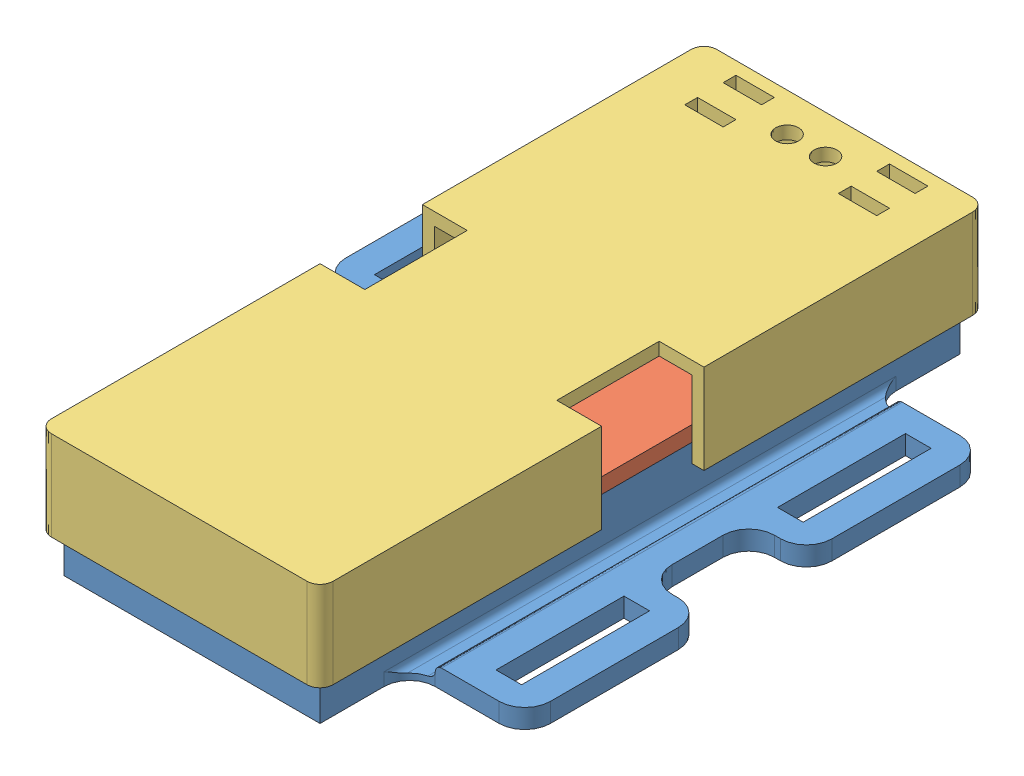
SolidWorks assembly EMG_FSR Assembly.SLDASM, configuration Default (file format 12000). Lengths in mm.
Overall size (38 13.87 52).
5 component instances, 4 part files, 9 mates.
Components (placement in the parent):
- Double-Wing Backplate-1: Double-Wing Backplate.SLDPRT [Default] at (20.2711 24.5646 36.8708) size (38 4.5 50)
- EMG_FSR PCB-1: EMG_FSR PCB.SLDPRT [Default] at (20.2711 30.2646 36.8708) x (-1 0 0) z (0 0 1) size (20 1.5 50)
- Double-Wing Enclosure-1: Double-Wing Enclosure.SLDPRT [Default] at (20.3211 34.7348 36.9208) x (-1 0 0) z (0 0 1) size (22 7 52)
- sEMG Electrode-1: sEMG Electrode.SLDPRT [Default] at (20.2711 24.4252 19.3708) x (-0.837169 0 -0.546944) z (-0.546944 0 0.837169) size (9.44 13 9.44)
- sEMG Electrode-2: sEMG Electrode.SLDPRT [Default] at (20.2711 24.4252 54.3708) x (-0.837169 0 -0.546944) z (-0.546944 0 0.837169) size (9.44 13 9.44)
Mates (geometry in assembly coordinates):
- Concentric5: concentric aligned: cylinder of Double-Wing Backplate-1 through (20.2711 24.5646 19.3708) axis (0 1 0) radius 1.625; cylinder of EMG_FSR PCB-1 through (20.2711 29.0646 19.3708) axis (0 1 0) radius 1.5
- Concentric6: concentric aligned: cylinder of Double-Wing Backplate-1 through (20.2711 24.5646 54.3708) axis (0 1 0) radius 1.625; cylinder of EMG_FSR PCB-1 through (20.2711 29.0646 54.3708) axis (0 1 0) radius 1.5
- Coincident5: coincident anti-aligned: plane of Double-Wing Backplate-1 through (20.2711 29.0646 36.8708) normal (0 1 0); plane of EMG_FSR PCB-1 through (20.2711 29.0646 36.8708) normal (0 -1 0)
- Coincident8: coincident anti-aligned: plane of Double-Wing Backplate-1 through (10.2711 29.0646 61.8708) normal (-1 0 0); plane of Double-Wing Enclosure-1 through (10.2711 33.7348 61.9708) normal (1 0 0)
- Coincident10: coincident anti-aligned: plane of Double-Wing Backplate-1 through (10.2711 29.0646 11.8708) normal (0 0 -1); plane of Double-Wing Enclosure-1 through (30.3711 33.7348 11.8708) normal (0 0 1)
- Coincident11: coincident anti-aligned: plane of Double-Wing Backplate-1 through (20.2711 24.5646 36.8708) normal (0 -1 0); plane of sEMG Electrode-2 through (19.0153 24.5646 53.5504) normal (0 1 0)
- Concentric7: concentric anti-aligned: cylinder of Double-Wing Backplate-1 through (20.2711 24.5646 54.3708) axis (0 1 0) radius 1.625; cylinder of sEMG Electrode-2 through (20.2711 20.8646 54.3708) axis (0 -1 0) radius 1.5
- Coincident12: coincident anti-aligned: plane of Double-Wing Backplate-1 through (20.2711 24.5646 36.8708) normal (0 -1 0); plane of sEMG Electrode-1 through (19.0153 24.5646 18.5504) normal (0 1 0)
- Concentric8: concentric anti-aligned: cylinder of Double-Wing Backplate-1 through (20.2711 24.5646 19.3708) axis (0 1 0) radius 1.625; cylinder of sEMG Electrode-1 through (20.2711 20.8646 19.3708) axis (0 -1 0) radius 1.5
